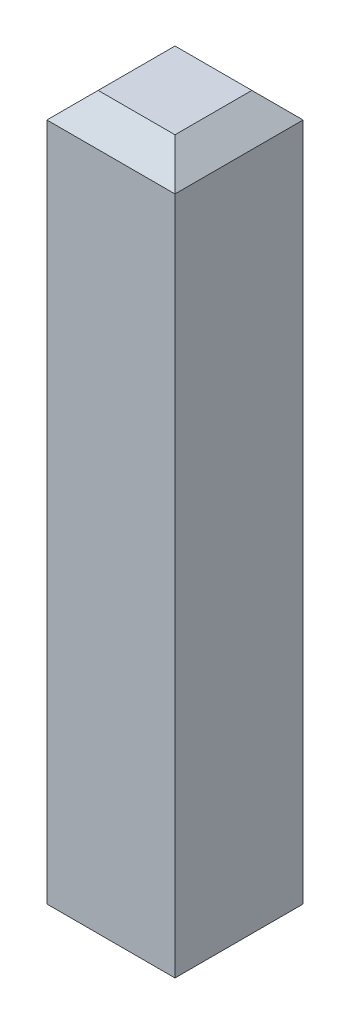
ISO-10303-21;
HEADER;
FILE_DESCRIPTION(('STEP AP214'),'2;1');
FILE_NAME('part.step','',(''),(''),'','','');
FILE_SCHEMA(('AUTOMOTIVE_DESIGN { 1 0 10303 214 1 1 1 1 }'));
ENDSEC;
DATA;
#1=APPLICATION_CONTEXT('core data for automotive mechanical design processes');
#2=APPLICATION_PROTOCOL_DEFINITION('international standard','automotive_design',2000,#1);
#3=PRODUCT_CONTEXT('',#1,'mechanical');
#4=PRODUCT('Part','Part','',(#3));
#5=PRODUCT_RELATED_PRODUCT_CATEGORY('part','',(#4));
#6=PRODUCT_DEFINITION_FORMATION('','',#4);
#7=PRODUCT_DEFINITION_CONTEXT('part definition',#1,'design');
#8=PRODUCT_DEFINITION('design','',#6,#7);
#9=PRODUCT_DEFINITION_SHAPE('','',#8);
#10=(LENGTH_UNIT() NAMED_UNIT(*) SI_UNIT(.MILLI.,.METRE.));
#11=(NAMED_UNIT(*) PLANE_ANGLE_UNIT() SI_UNIT($,.RADIAN.));
#12=(NAMED_UNIT(*) SI_UNIT($,.STERADIAN.) SOLID_ANGLE_UNIT());
#13=UNCERTAINTY_MEASURE_WITH_UNIT(LENGTH_MEASURE(1.E-05),#10,'distance_accuracy_value','');
#14=(GEOMETRIC_REPRESENTATION_CONTEXT(3) GLOBAL_UNCERTAINTY_ASSIGNED_CONTEXT((#13)) GLOBAL_UNIT_ASSIGNED_CONTEXT((#10,
#11,#12)) REPRESENTATION_CONTEXT('',''));
#15=CARTESIAN_POINT('',(0.,0.,0.));
#16=DIRECTION('',(0.,0.,1.));
#17=DIRECTION('',(1.,0.,0.));
#18=AXIS2_PLACEMENT_3D('',#15,#16,#17);
#19=CARTESIAN_POINT('',(-0.25,2.75,-0.25));
#20=DIRECTION('',(1.,0.,0.));
#21=DIRECTION('',(0.,0.,-1.));
#22=AXIS2_PLACEMENT_3D('',#19,#20,#21);
#23=PLANE('',#22);
#24=DIRECTION('',(0.,-1.,0.));
#25=VECTOR('',#24,1.);
#26=CARTESIAN_POINT('',(-0.25,2.75,0.25));
#27=LINE('',#26,#25);
#28=CARTESIAN_POINT('',(-0.25,2.65,0.25));
#29=VERTEX_POINT('',#28);
#30=CARTESIAN_POINT('',(-0.25,0.,0.25));
#31=VERTEX_POINT('',#30);
#32=EDGE_CURVE('E84',#29,#31,#27,.T.);
#33=ORIENTED_EDGE('',*,*,#32,.F.);
#34=DIRECTION('',(0.,0.,-1.));
#35=VECTOR('',#34,1.);
#36=CARTESIAN_POINT('',(-0.25,2.65,-0.25));
#37=LINE('',#36,#35);
#38=CARTESIAN_POINT('',(-0.25,2.65,-0.25));
#39=VERTEX_POINT('',#38);
#40=EDGE_CURVE('E128',#29,#39,#37,.T.);
#41=ORIENTED_EDGE('',*,*,#40,.T.);
#42=DIRECTION('',(0.,-1.,0.));
#43=VECTOR('',#42,1.);
#44=CARTESIAN_POINT('',(-0.25,2.75,-0.25));
#45=LINE('',#44,#43);
#46=CARTESIAN_POINT('',(-0.25,0.,-0.25));
#47=VERTEX_POINT('',#46);
#48=EDGE_CURVE('E104',#39,#47,#45,.T.);
#49=ORIENTED_EDGE('',*,*,#48,.T.);
#50=DIRECTION('',(0.,0.,1.));
#51=VECTOR('',#50,1.);
#52=CARTESIAN_POINT('',(-0.25,0.,-0.25));
#53=LINE('',#52,#51);
#54=EDGE_CURVE('E99',#47,#31,#53,.T.);
#55=ORIENTED_EDGE('',*,*,#54,.T.);
#56=EDGE_LOOP('',(#33,#41,#49,#55));
#57=FACE_BOUND('',#56,.T.);
#58=ADVANCED_FACE('F33',(#57),#23,.F.);
#59=CARTESIAN_POINT('',(-0.25,2.75,0.25));
#60=DIRECTION('',(0.,0.,-1.));
#61=DIRECTION('',(-1.,0.,0.));
#62=AXIS2_PLACEMENT_3D('',#59,#60,#61);
#63=PLANE('',#62);
#64=DIRECTION('',(0.,-1.,0.));
#65=VECTOR('',#64,1.);
#66=CARTESIAN_POINT('',(0.25,2.75,0.25));
#67=LINE('',#66,#65);
#68=CARTESIAN_POINT('',(0.25,2.65,0.25));
#69=VERTEX_POINT('',#68);
#70=CARTESIAN_POINT('',(0.25,0.,0.25));
#71=VERTEX_POINT('',#70);
#72=EDGE_CURVE('E93',#69,#71,#67,.T.);
#73=ORIENTED_EDGE('',*,*,#72,.F.);
#74=DIRECTION('',(-1.,0.,0.));
#75=VECTOR('',#74,1.);
#76=CARTESIAN_POINT('',(-0.25,2.65,0.25));
#77=LINE('',#76,#75);
#78=EDGE_CURVE('E42',#69,#29,#77,.T.);
#79=ORIENTED_EDGE('',*,*,#78,.T.);
#80=ORIENTED_EDGE('',*,*,#32,.T.);
#81=DIRECTION('',(1.,0.,0.));
#82=VECTOR('',#81,1.);
#83=CARTESIAN_POINT('',(-0.25,0.,0.25));
#84=LINE('',#83,#82);
#85=EDGE_CURVE('E87',#31,#71,#84,.T.);
#86=ORIENTED_EDGE('',*,*,#85,.T.);
#87=EDGE_LOOP('',(#73,#79,#80,#86));
#88=FACE_BOUND('',#87,.T.);
#89=ADVANCED_FACE('F86',(#88),#63,.F.);
#90=CARTESIAN_POINT('',(0.25,2.75,-0.25));
#91=DIRECTION('',(-1.,0.,0.));
#92=DIRECTION('',(0.,0.,1.));
#93=AXIS2_PLACEMENT_3D('',#90,#91,#92);
#94=PLANE('',#93);
#95=DIRECTION('',(0.,-1.,0.));
#96=VECTOR('',#95,1.);
#97=CARTESIAN_POINT('',(0.25,2.75,-0.25));
#98=LINE('',#97,#96);
#99=CARTESIAN_POINT('',(0.25,2.65,-0.25));
#100=VERTEX_POINT('',#99);
#101=CARTESIAN_POINT('',(0.25,0.,-0.25));
#102=VERTEX_POINT('',#101);
#103=EDGE_CURVE('E114',#100,#102,#98,.T.);
#104=ORIENTED_EDGE('',*,*,#103,.F.);
#105=DIRECTION('',(0.,0.,1.));
#106=VECTOR('',#105,1.);
#107=CARTESIAN_POINT('',(0.25,2.65,0.25));
#108=LINE('',#107,#106);
#109=EDGE_CURVE('E11',#100,#69,#108,.T.);
#110=ORIENTED_EDGE('',*,*,#109,.T.);
#111=ORIENTED_EDGE('',*,*,#72,.T.);
#112=DIRECTION('',(0.,0.,-1.));
#113=VECTOR('',#112,1.);
#114=CARTESIAN_POINT('',(0.25,0.,-0.25));
#115=LINE('',#114,#113);
#116=EDGE_CURVE('E101',#71,#102,#115,.T.);
#117=ORIENTED_EDGE('',*,*,#116,.T.);
#118=EDGE_LOOP('',(#104,#110,#111,#117));
#119=FACE_BOUND('',#118,.T.);
#120=ADVANCED_FACE('F153',(#119),#94,.F.);
#121=CARTESIAN_POINT('',(-0.25,2.75,-0.25));
#122=DIRECTION('',(0.,0.,1.));
#123=DIRECTION('',(1.,0.,0.));
#124=AXIS2_PLACEMENT_3D('',#121,#122,#123);
#125=PLANE('',#124);
#126=ORIENTED_EDGE('',*,*,#48,.F.);
#127=DIRECTION('',(1.,0.,0.));
#128=VECTOR('',#127,1.);
#129=CARTESIAN_POINT('',(0.25,2.65,-0.25));
#130=LINE('',#129,#128);
#131=EDGE_CURVE('E125',#39,#100,#130,.T.);
#132=ORIENTED_EDGE('',*,*,#131,.T.);
#133=ORIENTED_EDGE('',*,*,#103,.T.);
#134=DIRECTION('',(-1.,0.,0.));
#135=VECTOR('',#134,1.);
#136=CARTESIAN_POINT('',(-0.25,0.,-0.25));
#137=LINE('',#136,#135);
#138=EDGE_CURVE('E111',#102,#47,#137,.T.);
#139=ORIENTED_EDGE('',*,*,#138,.T.);
#140=EDGE_LOOP('',(#126,#132,#133,#139));
#141=FACE_BOUND('',#140,.T.);
#142=ADVANCED_FACE('F152',(#141),#125,.F.);
#143=CARTESIAN_POINT('',(0.,2.75,0.));
#144=DIRECTION('',(0.,1.,0.));
#145=DIRECTION('',(0.,0.,1.));
#146=AXIS2_PLACEMENT_3D('',#143,#144,#145);
#147=PLANE('',#146);
#148=DIRECTION('',(0.,0.,-1.));
#149=VECTOR('',#148,1.);
#150=CARTESIAN_POINT('',(0.15,2.75,-0.25));
#151=LINE('',#150,#149);
#152=CARTESIAN_POINT('',(0.15,2.75,0.15));
#153=VERTEX_POINT('',#152);
#154=CARTESIAN_POINT('',(0.15,2.75,-0.15));
#155=VERTEX_POINT('',#154);
#156=EDGE_CURVE('E92',#153,#155,#151,.T.);
#157=ORIENTED_EDGE('',*,*,#156,.T.);
#158=DIRECTION('',(-1.,0.,0.));
#159=VECTOR('',#158,1.);
#160=CARTESIAN_POINT('',(-0.25,2.75,-0.15));
#161=LINE('',#160,#159);
#162=CARTESIAN_POINT('',(-0.15,2.75,-0.15));
#163=VERTEX_POINT('',#162);
#164=EDGE_CURVE('E122',#155,#163,#161,.T.);
#165=ORIENTED_EDGE('',*,*,#164,.T.);
#166=DIRECTION('',(0.,0.,1.));
#167=VECTOR('',#166,1.);
#168=CARTESIAN_POINT('',(-0.15,2.75,0.25));
#169=LINE('',#168,#167);
#170=CARTESIAN_POINT('',(-0.15,2.75,0.15));
#171=VERTEX_POINT('',#170);
#172=EDGE_CURVE('E120',#163,#171,#169,.T.);
#173=ORIENTED_EDGE('',*,*,#172,.T.);
#174=DIRECTION('',(1.,0.,0.));
#175=VECTOR('',#174,1.);
#176=CARTESIAN_POINT('',(0.25,2.75,0.15));
#177=LINE('',#176,#175);
#178=EDGE_CURVE('E118',#171,#153,#177,.T.);
#179=ORIENTED_EDGE('',*,*,#178,.T.);
#180=EDGE_LOOP('',(#157,#165,#173,#179));
#181=FACE_BOUND('',#180,.T.);
#182=ADVANCED_FACE('F145',(#181),#147,.T.);
#183=CARTESIAN_POINT('',(0.,0.,0.));
#184=DIRECTION('',(0.,1.,0.));
#185=DIRECTION('',(0.,0.,1.));
#186=AXIS2_PLACEMENT_3D('',#183,#184,#185);
#187=PLANE('',#186);
#188=ORIENTED_EDGE('',*,*,#54,.F.);
#189=ORIENTED_EDGE('',*,*,#138,.F.);
#190=ORIENTED_EDGE('',*,*,#116,.F.);
#191=ORIENTED_EDGE('',*,*,#85,.F.);
#192=EDGE_LOOP('',(#188,#189,#190,#191));
#193=FACE_BOUND('',#192,.T.);
#194=ADVANCED_FACE('F97',(#193),#187,.F.);
#195=CARTESIAN_POINT('',(0.,2.75,0.15));
#196=DIRECTION('',(0.,0.707106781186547,0.707106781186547));
#197=DIRECTION('',(-1.,0.,0.));
#198=AXIS2_PLACEMENT_3D('',#195,#196,#197);
#199=PLANE('',#198);
#200=DIRECTION('',(-0.577350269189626,-0.577350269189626,0.577350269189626));
#201=VECTOR('',#200,1.);
#202=CARTESIAN_POINT('',(-0.1,2.8,0.1));
#203=LINE('',#202,#201);
#204=EDGE_CURVE('E108',#29,#171,#203,.F.);
#205=ORIENTED_EDGE('',*,*,#204,.F.);
#206=ORIENTED_EDGE('',*,*,#78,.F.);
#207=DIRECTION('',(0.577350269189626,-0.577350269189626,0.577350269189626));
#208=VECTOR('',#207,1.);
#209=CARTESIAN_POINT('',(0.1,2.8,0.1));
#210=LINE('',#209,#208);
#211=EDGE_CURVE('E37',#153,#69,#210,.T.);
#212=ORIENTED_EDGE('',*,*,#211,.F.);
#213=ORIENTED_EDGE('',*,*,#178,.F.);
#214=EDGE_LOOP('',(#205,#206,#212,#213));
#215=FACE_BOUND('',#214,.T.);
#216=ADVANCED_FACE('F35',(#215),#199,.T.);
#217=CARTESIAN_POINT('',(0.15,2.75,0.));
#218=DIRECTION('',(0.707106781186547,0.707106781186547,0.));
#219=DIRECTION('',(0.,0.,1.));
#220=AXIS2_PLACEMENT_3D('',#217,#218,#219);
#221=PLANE('',#220);
#222=ORIENTED_EDGE('',*,*,#211,.T.);
#223=ORIENTED_EDGE('',*,*,#109,.F.);
#224=DIRECTION('',(-0.577350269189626,0.577350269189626,0.577350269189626));
#225=VECTOR('',#224,1.);
#226=CARTESIAN_POINT('',(0.1,2.8,-0.1));
#227=LINE('',#226,#225);
#228=EDGE_CURVE('E133',#155,#100,#227,.F.);
#229=ORIENTED_EDGE('',*,*,#228,.F.);
#230=ORIENTED_EDGE('',*,*,#156,.F.);
#231=EDGE_LOOP('',(#222,#223,#229,#230));
#232=FACE_BOUND('',#231,.T.);
#233=ADVANCED_FACE('F170',(#232),#221,.T.);
#234=CARTESIAN_POINT('',(-0.15,2.75,0.));
#235=DIRECTION('',(-0.707106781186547,0.707106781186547,0.));
#236=DIRECTION('',(0.,0.,-1.));
#237=AXIS2_PLACEMENT_3D('',#234,#235,#236);
#238=PLANE('',#237);
#239=ORIENTED_EDGE('',*,*,#204,.T.);
#240=ORIENTED_EDGE('',*,*,#172,.F.);
#241=DIRECTION('',(-0.577350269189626,-0.577350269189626,-0.577350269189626));
#242=VECTOR('',#241,1.);
#243=CARTESIAN_POINT('',(-0.1,2.8,-0.1));
#244=LINE('',#243,#242);
#245=EDGE_CURVE('E131',#39,#163,#244,.F.);
#246=ORIENTED_EDGE('',*,*,#245,.F.);
#247=ORIENTED_EDGE('',*,*,#40,.F.);
#248=EDGE_LOOP('',(#239,#240,#246,#247));
#249=FACE_BOUND('',#248,.T.);
#250=ADVANCED_FACE('F138',(#249),#238,.T.);
#251=CARTESIAN_POINT('',(0.,2.75,-0.15));
#252=DIRECTION('',(0.,0.707106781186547,-0.707106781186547));
#253=DIRECTION('',(1.,0.,0.));
#254=AXIS2_PLACEMENT_3D('',#251,#252,#253);
#255=PLANE('',#254);
#256=ORIENTED_EDGE('',*,*,#228,.T.);
#257=ORIENTED_EDGE('',*,*,#131,.F.);
#258=ORIENTED_EDGE('',*,*,#245,.T.);
#259=ORIENTED_EDGE('',*,*,#164,.F.);
#260=EDGE_LOOP('',(#256,#257,#258,#259));
#261=FACE_BOUND('',#260,.T.);
#262=ADVANCED_FACE('F149',(#261),#255,.T.);
#263=CLOSED_SHELL('',(#58,#89,#120,#142,#182,#194,#216,#233,#250,#262));
#264=MANIFOLD_SOLID_BREP('B2',#263);
#265=ADVANCED_BREP_SHAPE_REPRESENTATION('',(#18,#264),#14);
#266=SHAPE_DEFINITION_REPRESENTATION(#9,#265);
ENDSEC;
END-ISO-10303-21;
